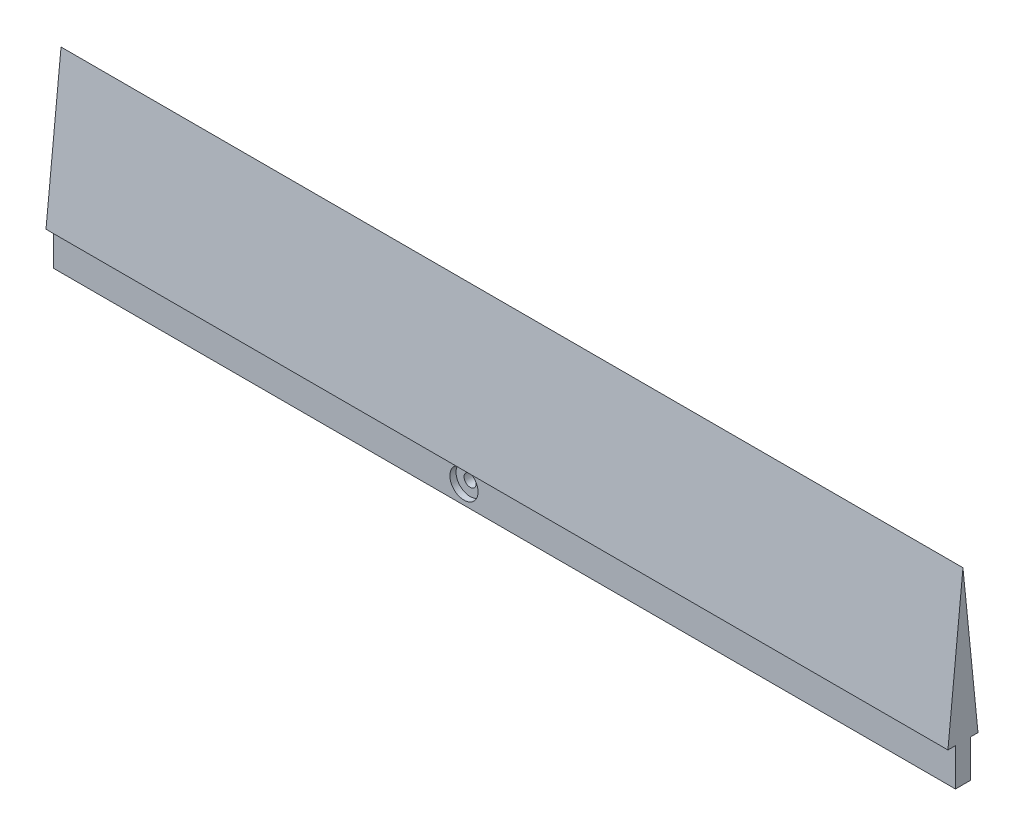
from build123d import *

# Parameters (mm, degrees)
EXTRUDE1_DEPTH                                      = 152.4
CBORE_FOR_1_BINDING_HEAD_MACHINE_SCREW1_D           = 2.0574
CBORE_FOR_1_BINDING_HEAD_MACHINE_SCREW1_CBORE_D     = 4.7625
CBORE_FOR_1_BINDING_HEAD_MACHINE_SCREW1_CBORE_DEPTH = 1.0414


with BuildPart() as part:
    # Sketch1 → Extrude1 (new body)
    with BuildSketch(Plane(origin=(0, 0, 0), x_dir=(0, 0, -1), z_dir=(1, 0, 0))):
        Polygon((-1.27, 0), (1.27, 0), (1.27, 6.35), (2.54, 6.35), (0, 31.75), (-2.54, 6.35), (-1.27, 6.35), align=None)
    extrude(amount=EXTRUDE1_DEPTH)

    # CBORE for _1 Binding Head Machine Screw1 (through all)
    with Locations(Plane(origin=(69.353872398, 3.136003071, 1.27), x_dir=(0, 1, 0), z_dir=(0, 0, 1))):
        with Locations((0, 0)):
            CounterBoreHole(CBORE_FOR_1_BINDING_HEAD_MACHINE_SCREW1_D / 2, CBORE_FOR_1_BINDING_HEAD_MACHINE_SCREW1_CBORE_D / 2, CBORE_FOR_1_BINDING_HEAD_MACHINE_SCREW1_CBORE_DEPTH)


solid = part.part
